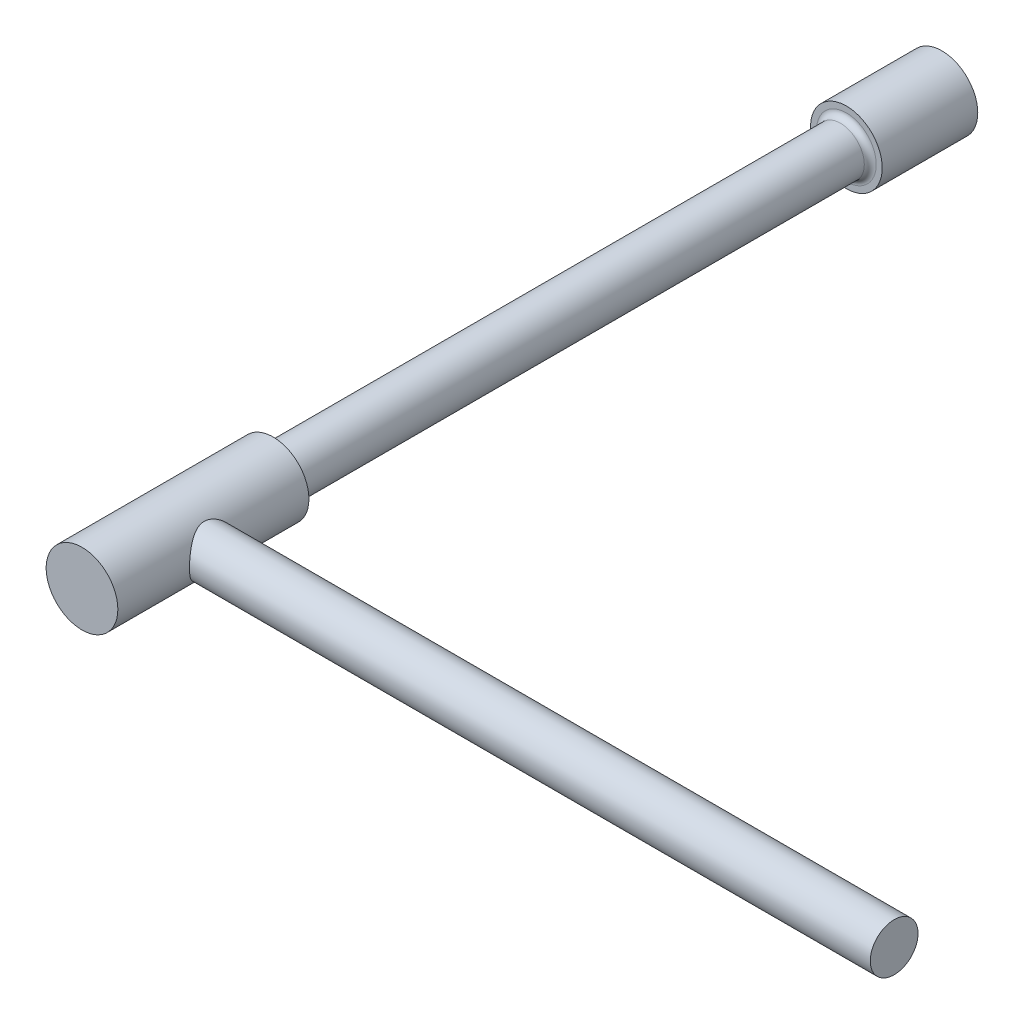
from build123d import *

# Parameters (mm, degrees)
CROQUIS1_R              = 19.05
SALIENTE_EXTRUIR1_DEPTH = 50.8
CROQUIS4_R              = 12.7
SALIENTE_EXTRUIR2_DEPTH = 301.625
CROQUIS5_R              = 19.05
SALIENTE_EXTRUIR3_DEPTH = 101.6
CROQUIS6_R              = 12.7
SALIENTE_EXTRUIR4_DEPTH = 381


with BuildPart() as part:
    # Croquis1 → Saliente-Extruir1 (new body)
    with BuildSketch(Plane.XY):
        Circle(CROQUIS1_R)
    extrude(amount=SALIENTE_EXTRUIR1_DEPTH)

    # Croquis2 → Revoluci_n2 (revolve)
    with BuildSketch(Plane(origin=(0, 0, 0), x_dir=(0, 0, -1), z_dir=(1, 0, 0))):
        with BuildLine():
            Line((-50.8, 0), (-53.975, 0))
            Line((-53.975, 0), (-53.975, 12.7))
            ThreePointArc((-53.975, 12.7), (-51.72993597, 13.62993597), (-50.8, 15.875))
            Line((-50.8, 15.875), (-50.8, 0))
        make_face()
    revolve(axis=Axis((0, 0, 50.8), (0, 0, 1)))

    # Croquis4 → Saliente-Extruir2 (add)
    with BuildSketch(Plane.XY.offset(53.975)):
        Circle(CROQUIS4_R)
    extrude(amount=SALIENTE_EXTRUIR2_DEPTH)

    # Croquis5 → Saliente-Extruir3 (add)
    with BuildSketch(Plane.XY.offset(355.6)):
        Circle(CROQUIS5_R)
    extrude(amount=SALIENTE_EXTRUIR3_DEPTH)

    # Croquis6 → Saliente-Extruir4 (add)
    with BuildSketch(Plane(origin=(0, 0, 0), x_dir=(0, 0, -1), z_dir=(1, 0, 0))):
        with Locations((-406.4, 0)):
            Circle(CROQUIS6_R)
    extrude(amount=SALIENTE_EXTRUIR4_DEPTH)


solid = part.part
